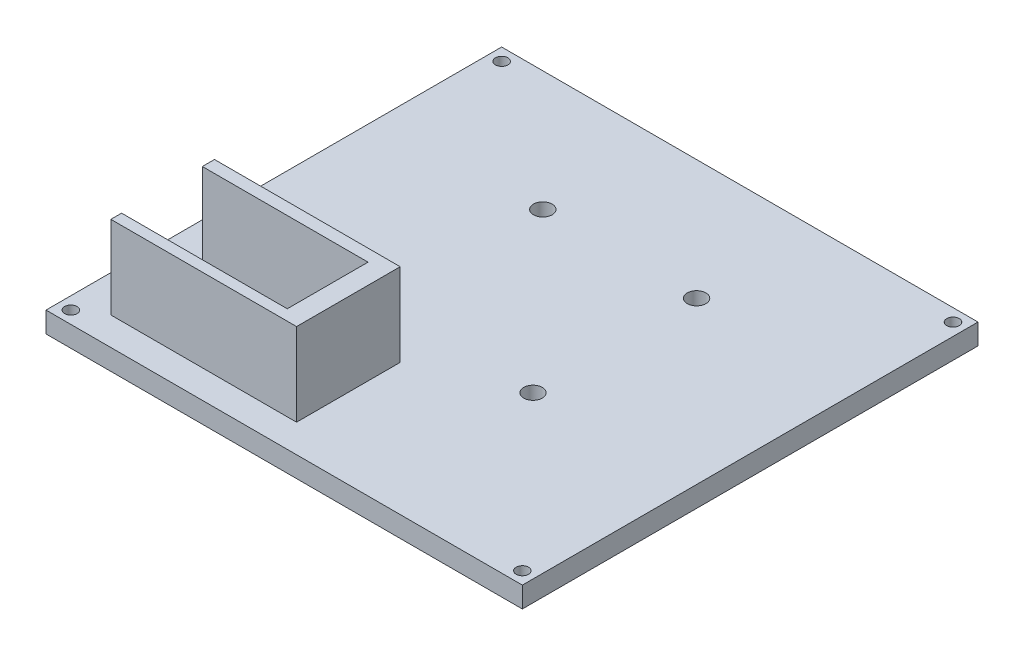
ISO-10303-21;
HEADER;
FILE_DESCRIPTION(('STEP AP214'),'2;1');
FILE_NAME('part.step','',(''),(''),'','','');
FILE_SCHEMA(('AUTOMOTIVE_DESIGN { 1 0 10303 214 1 1 1 1 }'));
ENDSEC;
DATA;
#1=APPLICATION_CONTEXT('core data for automotive mechanical design processes');
#2=APPLICATION_PROTOCOL_DEFINITION('international standard','automotive_design',2000,#1);
#3=PRODUCT_CONTEXT('',#1,'mechanical');
#4=PRODUCT('Part','Part','',(#3));
#5=PRODUCT_RELATED_PRODUCT_CATEGORY('part','',(#4));
#6=PRODUCT_DEFINITION_FORMATION('','',#4);
#7=PRODUCT_DEFINITION_CONTEXT('part definition',#1,'design');
#8=PRODUCT_DEFINITION('design','',#6,#7);
#9=PRODUCT_DEFINITION_SHAPE('','',#8);
#10=(LENGTH_UNIT() NAMED_UNIT(*) SI_UNIT(.MILLI.,.METRE.));
#11=(NAMED_UNIT(*) PLANE_ANGLE_UNIT() SI_UNIT($,.RADIAN.));
#12=(NAMED_UNIT(*) SI_UNIT($,.STERADIAN.) SOLID_ANGLE_UNIT());
#13=UNCERTAINTY_MEASURE_WITH_UNIT(LENGTH_MEASURE(1.E-05),#10,'distance_accuracy_value','');
#14=(GEOMETRIC_REPRESENTATION_CONTEXT(3) GLOBAL_UNCERTAINTY_ASSIGNED_CONTEXT((#13)) GLOBAL_UNIT_ASSIGNED_CONTEXT((#10,
#11,#12)) REPRESENTATION_CONTEXT('',''));
#15=CARTESIAN_POINT('',(0.,0.,0.));
#16=DIRECTION('',(0.,0.,1.));
#17=DIRECTION('',(1.,0.,0.));
#18=AXIS2_PLACEMENT_3D('',#15,#16,#17);
#19=CARTESIAN_POINT('',(0.,5.,0.));
#20=DIRECTION('',(0.,1.,0.));
#21=DIRECTION('',(0.,0.,1.));
#22=AXIS2_PLACEMENT_3D('',#19,#20,#21);
#23=PLANE('',#22);
#24=CARTESIAN_POINT('',(-26.882599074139,5.,32.0729223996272));
#25=DIRECTION('',(0.,1.,0.));
#26=DIRECTION('',(0.,0.,1.));
#27=AXIS2_PLACEMENT_3D('',#24,#25,#26);
#28=CIRCLE('',#27,2.25);
#29=CARTESIAN_POINT('',(-26.882599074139,5.,34.3229223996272));
#30=VERTEX_POINT('',#29);
#31=EDGE_CURVE('E377',#30,#30,#28,.T.);
#32=ORIENTED_EDGE('',*,*,#31,.F.);
#33=EDGE_LOOP('',(#32));
#34=FACE_BOUND('',#33,.T.);
#35=CARTESIAN_POINT('',(10.25343866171,5.,-7.4270776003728));
#36=DIRECTION('',(0.,1.,0.));
#37=DIRECTION('',(0.,0.,1.));
#38=AXIS2_PLACEMENT_3D('',#35,#36,#37);
#39=CIRCLE('',#38,2.25);
#40=CARTESIAN_POINT('',(10.25343866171,5.,-5.1770776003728));
#41=VERTEX_POINT('',#40);
#42=EDGE_CURVE('E373',#41,#41,#39,.T.);
#43=ORIENTED_EDGE('',*,*,#42,.F.);
#44=EDGE_LOOP('',(#43));
#45=FACE_BOUND('',#44,.T.);
#46=CARTESIAN_POINT('',(10.25343866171,5.,32.0729223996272));
#47=DIRECTION('',(0.,1.,0.));
#48=DIRECTION('',(0.,0.,1.));
#49=AXIS2_PLACEMENT_3D('',#46,#47,#48);
#50=CIRCLE('',#49,2.25);
#51=CARTESIAN_POINT('',(10.25343866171,5.,34.3229223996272));
#52=VERTEX_POINT('',#51);
#53=EDGE_CURVE('E368',#52,#52,#50,.T.);
#54=ORIENTED_EDGE('',*,*,#53,.F.);
#55=EDGE_LOOP('',(#54));
#56=FACE_BOUND('',#55,.T.);
#57=CARTESIAN_POINT('',(-26.882599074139,5.,-7.4270776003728));
#58=DIRECTION('',(0.,1.,0.));
#59=DIRECTION('',(0.,0.,1.));
#60=AXIS2_PLACEMENT_3D('',#57,#58,#59);
#61=CIRCLE('',#60,2.25);
#62=CARTESIAN_POINT('',(-26.882599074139,5.,-5.1770776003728));
#63=VERTEX_POINT('',#62);
#64=EDGE_CURVE('E380',#63,#63,#61,.T.);
#65=ORIENTED_EDGE('',*,*,#64,.F.);
#66=EDGE_LOOP('',(#65));
#67=FACE_BOUND('',#66,.T.);
#68=CARTESIAN_POINT('',(-62.81656133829,5.,70.5729223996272));
#69=DIRECTION('',(0.,1.,0.));
#70=DIRECTION('',(0.,0.,1.));
#71=AXIS2_PLACEMENT_3D('',#68,#69,#70);
#72=CIRCLE('',#71,1.5);
#73=CARTESIAN_POINT('',(-62.81656133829,5.,72.0729223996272));
#74=VERTEX_POINT('',#73);
#75=EDGE_CURVE('E201',#74,#74,#72,.T.);
#76=ORIENTED_EDGE('',*,*,#75,.F.);
#77=EDGE_LOOP('',(#76));
#78=FACE_BOUND('',#77,.T.);
#79=CARTESIAN_POINT('',(-62.81656133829,5.,-33.4270776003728));
#80=DIRECTION('',(0.,1.,0.));
#81=DIRECTION('',(0.,0.,1.));
#82=AXIS2_PLACEMENT_3D('',#79,#80,#81);
#83=CIRCLE('',#82,1.5);
#84=CARTESIAN_POINT('',(-62.81656133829,5.,-31.9270776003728));
#85=VERTEX_POINT('',#84);
#86=EDGE_CURVE('E213',#85,#85,#83,.T.);
#87=ORIENTED_EDGE('',*,*,#86,.F.);
#88=EDGE_LOOP('',(#87));
#89=FACE_BOUND('',#88,.T.);
#90=DIRECTION('',(0.,0.,1.));
#91=VECTOR('',#90,1.);
#92=CARTESIAN_POINT('',(-65.81656133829,5.,-36.4270776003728));
#93=LINE('',#92,#91);
#94=CARTESIAN_POINT('',(-65.81656133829,5.,-36.4270776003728));
#95=VERTEX_POINT('',#94);
#96=CARTESIAN_POINT('',(-65.81656133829,5.,73.5729223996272));
#97=VERTEX_POINT('',#96);
#98=EDGE_CURVE('E219',#95,#97,#93,.T.);
#99=ORIENTED_EDGE('',*,*,#98,.T.);
#100=DIRECTION('',(1.,0.,0.));
#101=VECTOR('',#100,1.);
#102=CARTESIAN_POINT('',(-65.81656133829,5.,73.5729223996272));
#103=LINE('',#102,#101);
#104=CARTESIAN_POINT('',(49.18343866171,5.,73.5729223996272));
#105=VERTEX_POINT('',#104);
#106=EDGE_CURVE('E222',#97,#105,#103,.T.);
#107=ORIENTED_EDGE('',*,*,#106,.T.);
#108=DIRECTION('',(0.,0.,-1.));
#109=VECTOR('',#108,1.);
#110=CARTESIAN_POINT('',(49.18343866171,5.,-36.4270776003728));
#111=LINE('',#110,#109);
#112=CARTESIAN_POINT('',(49.18343866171,5.,-36.4270776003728));
#113=VERTEX_POINT('',#112);
#114=EDGE_CURVE('E225',#105,#113,#111,.T.);
#115=ORIENTED_EDGE('',*,*,#114,.T.);
#116=DIRECTION('',(-1.,0.,0.));
#117=VECTOR('',#116,1.);
#118=CARTESIAN_POINT('',(-65.81656133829,5.,-36.4270776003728));
#119=LINE('',#118,#117);
#120=EDGE_CURVE('E227',#113,#95,#119,.T.);
#121=ORIENTED_EDGE('',*,*,#120,.T.);
#122=EDGE_LOOP('',(#99,#107,#115,#121));
#123=FACE_BOUND('',#122,.T.);
#124=CARTESIAN_POINT('',(46.18343866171,5.,-33.3940520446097));
#125=DIRECTION('',(0.,1.,0.));
#126=DIRECTION('',(0.,0.,1.));
#127=AXIS2_PLACEMENT_3D('',#124,#125,#126);
#128=CIRCLE('',#127,1.5);
#129=CARTESIAN_POINT('',(46.18343866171,5.,-31.8940520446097));
#130=VERTEX_POINT('',#129);
#131=EDGE_CURVE('E207',#130,#130,#128,.T.);
#132=ORIENTED_EDGE('',*,*,#131,.F.);
#133=EDGE_LOOP('',(#132));
#134=FACE_BOUND('',#133,.T.);
#135=CARTESIAN_POINT('',(46.18343866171,5.,70.5729223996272));
#136=DIRECTION('',(0.,1.,0.));
#137=DIRECTION('',(0.,0.,1.));
#138=AXIS2_PLACEMENT_3D('',#135,#136,#137);
#139=CIRCLE('',#138,1.5);
#140=CARTESIAN_POINT('',(46.18343866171,5.,72.0729223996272));
#141=VERTEX_POINT('',#140);
#142=EDGE_CURVE('E195',#141,#141,#139,.T.);
#143=ORIENTED_EDGE('',*,*,#142,.F.);
#144=EDGE_LOOP('',(#143));
#145=FACE_BOUND('',#144,.T.);
#146=DIRECTION('',(0.,0.,-1.));
#147=VECTOR('',#146,1.);
#148=CARTESIAN_POINT('',(-16.961839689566,5.,0.));
#149=LINE('',#148,#147);
#150=CARTESIAN_POINT('',(-16.961839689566,5.,64.181722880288));
#151=VERTEX_POINT('',#150);
#152=CARTESIAN_POINT('',(-16.961839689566,5.,44.681722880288));
#153=VERTEX_POINT('',#152);
#154=EDGE_CURVE('E49',#151,#153,#149,.T.);
#155=ORIENTED_EDGE('',*,*,#154,.T.);
#156=DIRECTION('',(1.,0.,0.));
#157=VECTOR('',#156,1.);
#158=CARTESIAN_POINT('',(0.,5.,44.681722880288));
#159=LINE('',#158,#157);
#160=CARTESIAN_POINT('',(-56.961839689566,5.,44.681722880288));
#161=VERTEX_POINT('',#160);
#162=EDGE_CURVE('E140',#161,#153,#159,.T.);
#163=ORIENTED_EDGE('',*,*,#162,.F.);
#164=DIRECTION('',(0.,0.,-1.));
#165=VECTOR('',#164,1.);
#166=CARTESIAN_POINT('',(-56.961839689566,5.,0.));
#167=LINE('',#166,#165);
#168=CARTESIAN_POINT('',(-56.961839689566,5.,41.7534532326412));
#169=VERTEX_POINT('',#168);
#170=EDGE_CURVE('E135',#161,#169,#167,.T.);
#171=ORIENTED_EDGE('',*,*,#170,.T.);
#172=DIRECTION('',(1.,0.,0.));
#173=VECTOR('',#172,1.);
#174=CARTESIAN_POINT('',(0.,5.,41.7534532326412));
#175=LINE('',#174,#173);
#176=CARTESIAN_POINT('',(-12.1251339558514,5.,41.7534532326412));
#177=VERTEX_POINT('',#176);
#178=EDGE_CURVE('E175',#169,#177,#175,.T.);
#179=ORIENTED_EDGE('',*,*,#178,.T.);
#180=DIRECTION('',(0.,0.,1.));
#181=VECTOR('',#180,1.);
#182=CARTESIAN_POINT('',(-12.1251339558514,5.,0.));
#183=LINE('',#182,#181);
#184=CARTESIAN_POINT('',(-12.1251339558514,5.,66.7754683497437));
#185=VERTEX_POINT('',#184);
#186=EDGE_CURVE('E173',#177,#185,#183,.T.);
#187=ORIENTED_EDGE('',*,*,#186,.T.);
#188=DIRECTION('',(1.,0.,0.));
#189=VECTOR('',#188,1.);
#190=CARTESIAN_POINT('',(0.,5.,66.7754683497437));
#191=LINE('',#190,#189);
#192=CARTESIAN_POINT('',(-56.961839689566,5.,66.7754683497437));
#193=VERTEX_POINT('',#192);
#194=EDGE_CURVE('E170',#193,#185,#191,.T.);
#195=ORIENTED_EDGE('',*,*,#194,.F.);
#196=DIRECTION('',(0.,0.,1.));
#197=VECTOR('',#196,1.);
#198=CARTESIAN_POINT('',(-56.961839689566,5.,0.));
#199=LINE('',#198,#197);
#200=CARTESIAN_POINT('',(-56.961839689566,5.,64.181722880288));
#201=VERTEX_POINT('',#200);
#202=EDGE_CURVE('E167',#201,#193,#199,.T.);
#203=ORIENTED_EDGE('',*,*,#202,.F.);
#204=DIRECTION('',(1.,0.,0.));
#205=VECTOR('',#204,1.);
#206=CARTESIAN_POINT('',(0.,5.,64.181722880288));
#207=LINE('',#206,#205);
#208=EDGE_CURVE('E54',#201,#151,#207,.T.);
#209=ORIENTED_EDGE('',*,*,#208,.T.);
#210=EDGE_LOOP('',(#155,#163,#171,#179,#187,#195,#203,#209));
#211=FACE_BOUND('',#210,.T.);
#212=ADVANCED_FACE('F34',(#34,#45,#56,#67,#78,#89,#123,#134,#145,#211),#23,.T.);
#213=CARTESIAN_POINT('',(0.,0.,0.));
#214=DIRECTION('',(0.,1.,0.));
#215=DIRECTION('',(0.,0.,1.));
#216=AXIS2_PLACEMENT_3D('',#213,#214,#215);
#217=PLANE('',#216);
#218=CARTESIAN_POINT('',(-26.882599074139,0.,32.0729223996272));
#219=DIRECTION('',(0.,1.,0.));
#220=DIRECTION('',(0.,0.,1.));
#221=AXIS2_PLACEMENT_3D('',#218,#219,#220);
#222=CIRCLE('',#221,2.25);
#223=CARTESIAN_POINT('',(-26.882599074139,0.,34.3229223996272));
#224=VERTEX_POINT('',#223);
#225=EDGE_CURVE('E381',#224,#224,#222,.T.);
#226=ORIENTED_EDGE('',*,*,#225,.T.);
#227=EDGE_LOOP('',(#226));
#228=FACE_BOUND('',#227,.T.);
#229=CARTESIAN_POINT('',(10.25343866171,0.,-7.4270776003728));
#230=DIRECTION('',(0.,1.,0.));
#231=DIRECTION('',(0.,0.,1.));
#232=AXIS2_PLACEMENT_3D('',#229,#230,#231);
#233=CIRCLE('',#232,2.25);
#234=CARTESIAN_POINT('',(10.25343866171,0.,-5.1770776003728));
#235=VERTEX_POINT('',#234);
#236=EDGE_CURVE('E370',#235,#235,#233,.T.);
#237=ORIENTED_EDGE('',*,*,#236,.T.);
#238=EDGE_LOOP('',(#237));
#239=FACE_BOUND('',#238,.T.);
#240=CARTESIAN_POINT('',(10.25343866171,0.,32.0729223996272));
#241=DIRECTION('',(0.,1.,0.));
#242=DIRECTION('',(0.,0.,1.));
#243=AXIS2_PLACEMENT_3D('',#240,#241,#242);
#244=CIRCLE('',#243,2.25);
#245=CARTESIAN_POINT('',(10.25343866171,0.,34.3229223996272));
#246=VERTEX_POINT('',#245);
#247=EDGE_CURVE('E365',#246,#246,#244,.T.);
#248=ORIENTED_EDGE('',*,*,#247,.T.);
#249=EDGE_LOOP('',(#248));
#250=FACE_BOUND('',#249,.T.);
#251=CARTESIAN_POINT('',(-26.882599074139,0.,-7.4270776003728));
#252=DIRECTION('',(0.,1.,0.));
#253=DIRECTION('',(0.,0.,1.));
#254=AXIS2_PLACEMENT_3D('',#251,#252,#253);
#255=CIRCLE('',#254,2.25);
#256=CARTESIAN_POINT('',(-26.882599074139,0.,-5.1770776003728));
#257=VERTEX_POINT('',#256);
#258=EDGE_CURVE('E164',#257,#257,#255,.T.);
#259=ORIENTED_EDGE('',*,*,#258,.T.);
#260=EDGE_LOOP('',(#259));
#261=FACE_BOUND('',#260,.T.);
#262=DIRECTION('',(0.,0.,1.));
#263=VECTOR('',#262,1.);
#264=CARTESIAN_POINT('',(-65.81656133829,0.,-36.4270776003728));
#265=LINE('',#264,#263);
#266=CARTESIAN_POINT('',(-65.81656133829,0.,-36.4270776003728));
#267=VERTEX_POINT('',#266);
#268=CARTESIAN_POINT('',(-65.81656133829,0.,73.5729223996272));
#269=VERTEX_POINT('',#268);
#270=EDGE_CURVE('E216',#267,#269,#265,.T.);
#271=ORIENTED_EDGE('',*,*,#270,.F.);
#272=DIRECTION('',(-1.,0.,0.));
#273=VECTOR('',#272,1.);
#274=CARTESIAN_POINT('',(-65.81656133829,0.,-36.4270776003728));
#275=LINE('',#274,#273);
#276=CARTESIAN_POINT('',(49.18343866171,0.,-36.4270776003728));
#277=VERTEX_POINT('',#276);
#278=EDGE_CURVE('E223',#277,#267,#275,.T.);
#279=ORIENTED_EDGE('',*,*,#278,.F.);
#280=DIRECTION('',(0.,0.,-1.));
#281=VECTOR('',#280,1.);
#282=CARTESIAN_POINT('',(49.18343866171,0.,-36.4270776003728));
#283=LINE('',#282,#281);
#284=CARTESIAN_POINT('',(49.18343866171,0.,73.5729223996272));
#285=VERTEX_POINT('',#284);
#286=EDGE_CURVE('E234',#285,#277,#283,.T.);
#287=ORIENTED_EDGE('',*,*,#286,.F.);
#288=DIRECTION('',(1.,0.,0.));
#289=VECTOR('',#288,1.);
#290=CARTESIAN_POINT('',(-65.81656133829,0.,73.5729223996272));
#291=LINE('',#290,#289);
#292=EDGE_CURVE('E232',#269,#285,#291,.T.);
#293=ORIENTED_EDGE('',*,*,#292,.F.);
#294=EDGE_LOOP('',(#271,#279,#287,#293));
#295=FACE_BOUND('',#294,.T.);
#296=CARTESIAN_POINT('',(-62.81656133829,0.,-33.4270776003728));
#297=DIRECTION('',(0.,1.,0.));
#298=DIRECTION('',(0.,0.,1.));
#299=AXIS2_PLACEMENT_3D('',#296,#297,#298);
#300=CIRCLE('',#299,1.5);
#301=CARTESIAN_POINT('',(-62.81656133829,0.,-31.9270776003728));
#302=VERTEX_POINT('',#301);
#303=EDGE_CURVE('E210',#302,#302,#300,.T.);
#304=ORIENTED_EDGE('',*,*,#303,.T.);
#305=EDGE_LOOP('',(#304));
#306=FACE_BOUND('',#305,.T.);
#307=CARTESIAN_POINT('',(46.18343866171,0.,-33.3940520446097));
#308=DIRECTION('',(0.,1.,0.));
#309=DIRECTION('',(0.,0.,1.));
#310=AXIS2_PLACEMENT_3D('',#307,#308,#309);
#311=CIRCLE('',#310,1.5);
#312=CARTESIAN_POINT('',(46.18343866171,0.,-31.8940520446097));
#313=VERTEX_POINT('',#312);
#314=EDGE_CURVE('E204',#313,#313,#311,.T.);
#315=ORIENTED_EDGE('',*,*,#314,.T.);
#316=EDGE_LOOP('',(#315));
#317=FACE_BOUND('',#316,.T.);
#318=CARTESIAN_POINT('',(-62.81656133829,0.,70.5729223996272));
#319=DIRECTION('',(0.,1.,0.));
#320=DIRECTION('',(0.,0.,1.));
#321=AXIS2_PLACEMENT_3D('',#318,#319,#320);
#322=CIRCLE('',#321,1.5);
#323=CARTESIAN_POINT('',(-62.81656133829,0.,72.0729223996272));
#324=VERTEX_POINT('',#323);
#325=EDGE_CURVE('E198',#324,#324,#322,.T.);
#326=ORIENTED_EDGE('',*,*,#325,.T.);
#327=EDGE_LOOP('',(#326));
#328=FACE_BOUND('',#327,.T.);
#329=CARTESIAN_POINT('',(46.18343866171,0.,70.5729223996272));
#330=DIRECTION('',(0.,1.,0.));
#331=DIRECTION('',(0.,0.,1.));
#332=AXIS2_PLACEMENT_3D('',#329,#330,#331);
#333=CIRCLE('',#332,1.5);
#334=CARTESIAN_POINT('',(46.18343866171,0.,72.0729223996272));
#335=VERTEX_POINT('',#334);
#336=EDGE_CURVE('E142',#335,#335,#333,.T.);
#337=ORIENTED_EDGE('',*,*,#336,.T.);
#338=EDGE_LOOP('',(#337));
#339=FACE_BOUND('',#338,.T.);
#340=ADVANCED_FACE('F252',(#228,#239,#250,#261,#295,#306,#317,#328,#339),#217,.F.);
#341=CARTESIAN_POINT('',(-65.81656133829,5.,-36.4270776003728));
#342=DIRECTION('',(1.,0.,0.));
#343=DIRECTION('',(0.,0.,-1.));
#344=AXIS2_PLACEMENT_3D('',#341,#342,#343);
#345=PLANE('',#344);
#346=ORIENTED_EDGE('',*,*,#270,.T.);
#347=DIRECTION('',(0.,-1.,0.));
#348=VECTOR('',#347,1.);
#349=CARTESIAN_POINT('',(-65.81656133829,5.,73.5729223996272));
#350=LINE('',#349,#348);
#351=EDGE_CURVE('E11',#97,#269,#350,.T.);
#352=ORIENTED_EDGE('',*,*,#351,.F.);
#353=ORIENTED_EDGE('',*,*,#98,.F.);
#354=DIRECTION('',(0.,-1.,0.));
#355=VECTOR('',#354,1.);
#356=CARTESIAN_POINT('',(-65.81656133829,5.,-36.4270776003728));
#357=LINE('',#356,#355);
#358=EDGE_CURVE('E229',#95,#267,#357,.T.);
#359=ORIENTED_EDGE('',*,*,#358,.T.);
#360=EDGE_LOOP('',(#346,#352,#353,#359));
#361=FACE_BOUND('',#360,.T.);
#362=ADVANCED_FACE('F36',(#361),#345,.F.);
#363=CARTESIAN_POINT('',(-65.81656133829,5.,73.5729223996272));
#364=DIRECTION('',(0.,0.,-1.));
#365=DIRECTION('',(-1.,0.,0.));
#366=AXIS2_PLACEMENT_3D('',#363,#364,#365);
#367=PLANE('',#366);
#368=ORIENTED_EDGE('',*,*,#292,.T.);
#369=DIRECTION('',(0.,-1.,0.));
#370=VECTOR('',#369,1.);
#371=CARTESIAN_POINT('',(49.18343866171,5.,73.5729223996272));
#372=LINE('',#371,#370);
#373=EDGE_CURVE('E42',#105,#285,#372,.T.);
#374=ORIENTED_EDGE('',*,*,#373,.F.);
#375=ORIENTED_EDGE('',*,*,#106,.F.);
#376=ORIENTED_EDGE('',*,*,#351,.T.);
#377=EDGE_LOOP('',(#368,#374,#375,#376));
#378=FACE_BOUND('',#377,.T.);
#379=ADVANCED_FACE('F263',(#378),#367,.F.);
#380=CARTESIAN_POINT('',(49.18343866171,5.,-36.4270776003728));
#381=DIRECTION('',(-1.,0.,0.));
#382=DIRECTION('',(0.,0.,1.));
#383=AXIS2_PLACEMENT_3D('',#380,#381,#382);
#384=PLANE('',#383);
#385=ORIENTED_EDGE('',*,*,#286,.T.);
#386=DIRECTION('',(0.,-1.,0.));
#387=VECTOR('',#386,1.);
#388=CARTESIAN_POINT('',(49.18343866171,5.,-36.4270776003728));
#389=LINE('',#388,#387);
#390=EDGE_CURVE('E239',#113,#277,#389,.T.);
#391=ORIENTED_EDGE('',*,*,#390,.F.);
#392=ORIENTED_EDGE('',*,*,#114,.F.);
#393=ORIENTED_EDGE('',*,*,#373,.T.);
#394=EDGE_LOOP('',(#385,#391,#392,#393));
#395=FACE_BOUND('',#394,.T.);
#396=ADVANCED_FACE('F246',(#395),#384,.F.);
#397=CARTESIAN_POINT('',(-65.81656133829,5.,-36.4270776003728));
#398=DIRECTION('',(0.,0.,1.));
#399=DIRECTION('',(1.,0.,0.));
#400=AXIS2_PLACEMENT_3D('',#397,#398,#399);
#401=PLANE('',#400);
#402=ORIENTED_EDGE('',*,*,#278,.T.);
#403=ORIENTED_EDGE('',*,*,#358,.F.);
#404=ORIENTED_EDGE('',*,*,#120,.F.);
#405=ORIENTED_EDGE('',*,*,#390,.T.);
#406=EDGE_LOOP('',(#402,#403,#404,#405));
#407=FACE_BOUND('',#406,.T.);
#408=ADVANCED_FACE('F256',(#407),#401,.F.);
#409=CARTESIAN_POINT('',(-62.81656133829,5.,-33.4270776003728));
#410=DIRECTION('',(0.,-1.,0.));
#411=DIRECTION('',(0.,0.,-1.));
#412=AXIS2_PLACEMENT_3D('',#409,#410,#411);
#413=CYLINDRICAL_SURFACE('',#412,1.5);
#414=ORIENTED_EDGE('',*,*,#86,.T.);
#415=EDGE_LOOP('',(#414));
#416=FACE_BOUND('',#415,.T.);
#417=ORIENTED_EDGE('',*,*,#303,.F.);
#418=EDGE_LOOP('',(#417));
#419=FACE_BOUND('',#418,.T.);
#420=ADVANCED_FACE('F281',(#416,#419),#413,.F.);
#421=CARTESIAN_POINT('',(46.18343866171,5.,-33.3940520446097));
#422=DIRECTION('',(0.,-1.,0.));
#423=DIRECTION('',(0.,0.,-1.));
#424=AXIS2_PLACEMENT_3D('',#421,#422,#423);
#425=CYLINDRICAL_SURFACE('',#424,1.5);
#426=ORIENTED_EDGE('',*,*,#131,.T.);
#427=EDGE_LOOP('',(#426));
#428=FACE_BOUND('',#427,.T.);
#429=ORIENTED_EDGE('',*,*,#314,.F.);
#430=EDGE_LOOP('',(#429));
#431=FACE_BOUND('',#430,.T.);
#432=ADVANCED_FACE('F288',(#428,#431),#425,.F.);
#433=CARTESIAN_POINT('',(-62.81656133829,5.,70.5729223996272));
#434=DIRECTION('',(0.,-1.,0.));
#435=DIRECTION('',(0.,0.,-1.));
#436=AXIS2_PLACEMENT_3D('',#433,#434,#435);
#437=CYLINDRICAL_SURFACE('',#436,1.5);
#438=ORIENTED_EDGE('',*,*,#75,.T.);
#439=EDGE_LOOP('',(#438));
#440=FACE_BOUND('',#439,.T.);
#441=ORIENTED_EDGE('',*,*,#325,.F.);
#442=EDGE_LOOP('',(#441));
#443=FACE_BOUND('',#442,.T.);
#444=ADVANCED_FACE('F293',(#440,#443),#437,.F.);
#445=CARTESIAN_POINT('',(46.18343866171,5.,70.5729223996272));
#446=DIRECTION('',(0.,-1.,0.));
#447=DIRECTION('',(0.,0.,-1.));
#448=AXIS2_PLACEMENT_3D('',#445,#446,#447);
#449=CYLINDRICAL_SURFACE('',#448,1.5);
#450=ORIENTED_EDGE('',*,*,#142,.T.);
#451=EDGE_LOOP('',(#450));
#452=FACE_BOUND('',#451,.T.);
#453=ORIENTED_EDGE('',*,*,#336,.F.);
#454=EDGE_LOOP('',(#453));
#455=FACE_BOUND('',#454,.T.);
#456=ADVANCED_FACE('F305',(#452,#455),#449,.F.);
#457=CARTESIAN_POINT('',(0.,25.,44.681722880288));
#458=DIRECTION('',(0.,0.,-1.));
#459=DIRECTION('',(-1.,0.,0.));
#460=AXIS2_PLACEMENT_3D('',#457,#458,#459);
#461=PLANE('',#460);
#462=ORIENTED_EDGE('',*,*,#162,.T.);
#463=DIRECTION('',(0.,-1.,0.));
#464=VECTOR('',#463,1.);
#465=CARTESIAN_POINT('',(-16.961839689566,25.,44.681722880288));
#466=LINE('',#465,#464);
#467=CARTESIAN_POINT('',(-16.961839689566,25.,44.681722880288));
#468=VERTEX_POINT('',#467);
#469=EDGE_CURVE('E138',#468,#153,#466,.T.);
#470=ORIENTED_EDGE('',*,*,#469,.F.);
#471=DIRECTION('',(1.,0.,0.));
#472=VECTOR('',#471,1.);
#473=CARTESIAN_POINT('',(0.,25.,44.681722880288));
#474=LINE('',#473,#472);
#475=CARTESIAN_POINT('',(-56.961839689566,25.,44.681722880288));
#476=VERTEX_POINT('',#475);
#477=EDGE_CURVE('E123',#476,#468,#474,.T.);
#478=ORIENTED_EDGE('',*,*,#477,.F.);
#479=DIRECTION('',(0.,-1.,0.));
#480=VECTOR('',#479,1.);
#481=CARTESIAN_POINT('',(-56.961839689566,25.,44.681722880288));
#482=LINE('',#481,#480);
#483=EDGE_CURVE('E162',#476,#161,#482,.T.);
#484=ORIENTED_EDGE('',*,*,#483,.T.);
#485=EDGE_LOOP('',(#462,#470,#478,#484));
#486=FACE_BOUND('',#485,.T.);
#487=ADVANCED_FACE('F139',(#486),#461,.F.);
#488=CARTESIAN_POINT('',(-16.961839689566,25.,0.));
#489=DIRECTION('',(-1.,0.,0.));
#490=DIRECTION('',(0.,0.,1.));
#491=AXIS2_PLACEMENT_3D('',#488,#489,#490);
#492=PLANE('',#491);
#493=ORIENTED_EDGE('',*,*,#154,.F.);
#494=DIRECTION('',(0.,-1.,0.));
#495=VECTOR('',#494,1.);
#496=CARTESIAN_POINT('',(-16.961839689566,25.,64.181722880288));
#497=LINE('',#496,#495);
#498=CARTESIAN_POINT('',(-16.961839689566,25.,64.181722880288));
#499=VERTEX_POINT('',#498);
#500=EDGE_CURVE('E143',#499,#151,#497,.T.);
#501=ORIENTED_EDGE('',*,*,#500,.F.);
#502=DIRECTION('',(0.,0.,-1.));
#503=VECTOR('',#502,1.);
#504=CARTESIAN_POINT('',(-16.961839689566,25.,0.));
#505=LINE('',#504,#503);
#506=EDGE_CURVE('E128',#499,#468,#505,.T.);
#507=ORIENTED_EDGE('',*,*,#506,.T.);
#508=ORIENTED_EDGE('',*,*,#469,.T.);
#509=EDGE_LOOP('',(#493,#501,#507,#508));
#510=FACE_BOUND('',#509,.T.);
#511=ADVANCED_FACE('F145',(#510),#492,.T.);
#512=CARTESIAN_POINT('',(0.,25.,64.181722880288));
#513=DIRECTION('',(0.,0.,-1.));
#514=DIRECTION('',(-1.,0.,0.));
#515=AXIS2_PLACEMENT_3D('',#512,#513,#514);
#516=PLANE('',#515);
#517=ORIENTED_EDGE('',*,*,#208,.F.);
#518=DIRECTION('',(0.,-1.,0.));
#519=VECTOR('',#518,1.);
#520=CARTESIAN_POINT('',(-56.961839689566,25.,64.181722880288));
#521=LINE('',#520,#519);
#522=CARTESIAN_POINT('',(-56.961839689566,25.,64.181722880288));
#523=VERTEX_POINT('',#522);
#524=EDGE_CURVE('E191',#523,#201,#521,.T.);
#525=ORIENTED_EDGE('',*,*,#524,.F.);
#526=DIRECTION('',(1.,0.,0.));
#527=VECTOR('',#526,1.);
#528=CARTESIAN_POINT('',(0.,25.,64.181722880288));
#529=LINE('',#528,#527);
#530=EDGE_CURVE('E146',#523,#499,#529,.T.);
#531=ORIENTED_EDGE('',*,*,#530,.T.);
#532=ORIENTED_EDGE('',*,*,#500,.T.);
#533=EDGE_LOOP('',(#517,#525,#531,#532));
#534=FACE_BOUND('',#533,.T.);
#535=ADVANCED_FACE('F319',(#534),#516,.T.);
#536=CARTESIAN_POINT('',(-56.961839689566,25.,0.));
#537=DIRECTION('',(1.,0.,0.));
#538=DIRECTION('',(0.,0.,-1.));
#539=AXIS2_PLACEMENT_3D('',#536,#537,#538);
#540=PLANE('',#539);
#541=ORIENTED_EDGE('',*,*,#202,.T.);
#542=DIRECTION('',(0.,-1.,0.));
#543=VECTOR('',#542,1.);
#544=CARTESIAN_POINT('',(-56.961839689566,25.,66.7754683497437));
#545=LINE('',#544,#543);
#546=CARTESIAN_POINT('',(-56.961839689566,25.,66.7754683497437));
#547=VERTEX_POINT('',#546);
#548=EDGE_CURVE('E188',#547,#193,#545,.T.);
#549=ORIENTED_EDGE('',*,*,#548,.F.);
#550=DIRECTION('',(0.,0.,1.));
#551=VECTOR('',#550,1.);
#552=CARTESIAN_POINT('',(-56.961839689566,25.,0.));
#553=LINE('',#552,#551);
#554=EDGE_CURVE('E148',#523,#547,#553,.T.);
#555=ORIENTED_EDGE('',*,*,#554,.F.);
#556=ORIENTED_EDGE('',*,*,#524,.T.);
#557=EDGE_LOOP('',(#541,#549,#555,#556));
#558=FACE_BOUND('',#557,.T.);
#559=ADVANCED_FACE('F322',(#558),#540,.F.);
#560=CARTESIAN_POINT('',(0.,25.,66.7754683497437));
#561=DIRECTION('',(0.,0.,-1.));
#562=DIRECTION('',(-1.,0.,0.));
#563=AXIS2_PLACEMENT_3D('',#560,#561,#562);
#564=PLANE('',#563);
#565=ORIENTED_EDGE('',*,*,#194,.T.);
#566=DIRECTION('',(0.,-1.,0.));
#567=VECTOR('',#566,1.);
#568=CARTESIAN_POINT('',(-12.1251339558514,25.,66.7754683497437));
#569=LINE('',#568,#567);
#570=CARTESIAN_POINT('',(-12.1251339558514,25.,66.7754683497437));
#571=VERTEX_POINT('',#570);
#572=EDGE_CURVE('E185',#571,#185,#569,.T.);
#573=ORIENTED_EDGE('',*,*,#572,.F.);
#574=DIRECTION('',(1.,0.,0.));
#575=VECTOR('',#574,1.);
#576=CARTESIAN_POINT('',(0.,25.,66.7754683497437));
#577=LINE('',#576,#575);
#578=EDGE_CURVE('E153',#547,#571,#577,.T.);
#579=ORIENTED_EDGE('',*,*,#578,.F.);
#580=ORIENTED_EDGE('',*,*,#548,.T.);
#581=EDGE_LOOP('',(#565,#573,#579,#580));
#582=FACE_BOUND('',#581,.T.);
#583=ADVANCED_FACE('F326',(#582),#564,.F.);
#584=CARTESIAN_POINT('',(-12.1251339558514,25.,0.));
#585=DIRECTION('',(1.,0.,0.));
#586=DIRECTION('',(0.,0.,-1.));
#587=AXIS2_PLACEMENT_3D('',#584,#585,#586);
#588=PLANE('',#587);
#589=ORIENTED_EDGE('',*,*,#186,.F.);
#590=DIRECTION('',(0.,-1.,0.));
#591=VECTOR('',#590,1.);
#592=CARTESIAN_POINT('',(-12.1251339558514,25.,41.7534532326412));
#593=LINE('',#592,#591);
#594=CARTESIAN_POINT('',(-12.1251339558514,25.,41.7534532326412));
#595=VERTEX_POINT('',#594);
#596=EDGE_CURVE('E182',#595,#177,#593,.T.);
#597=ORIENTED_EDGE('',*,*,#596,.F.);
#598=DIRECTION('',(0.,0.,1.));
#599=VECTOR('',#598,1.);
#600=CARTESIAN_POINT('',(-12.1251339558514,25.,0.));
#601=LINE('',#600,#599);
#602=EDGE_CURVE('E155',#595,#571,#601,.T.);
#603=ORIENTED_EDGE('',*,*,#602,.T.);
#604=ORIENTED_EDGE('',*,*,#572,.T.);
#605=EDGE_LOOP('',(#589,#597,#603,#604));
#606=FACE_BOUND('',#605,.T.);
#607=ADVANCED_FACE('F330',(#606),#588,.T.);
#608=CARTESIAN_POINT('',(0.,25.,41.7534532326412));
#609=DIRECTION('',(0.,0.,-1.));
#610=DIRECTION('',(-1.,0.,0.));
#611=AXIS2_PLACEMENT_3D('',#608,#609,#610);
#612=PLANE('',#611);
#613=ORIENTED_EDGE('',*,*,#178,.F.);
#614=DIRECTION('',(0.,-1.,0.));
#615=VECTOR('',#614,1.);
#616=CARTESIAN_POINT('',(-56.961839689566,25.,41.7534532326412));
#617=LINE('',#616,#615);
#618=CARTESIAN_POINT('',(-56.961839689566,25.,41.7534532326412));
#619=VERTEX_POINT('',#618);
#620=EDGE_CURVE('E179',#619,#169,#617,.T.);
#621=ORIENTED_EDGE('',*,*,#620,.F.);
#622=DIRECTION('',(1.,0.,0.));
#623=VECTOR('',#622,1.);
#624=CARTESIAN_POINT('',(0.,25.,41.7534532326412));
#625=LINE('',#624,#623);
#626=EDGE_CURVE('E158',#619,#595,#625,.T.);
#627=ORIENTED_EDGE('',*,*,#626,.T.);
#628=ORIENTED_EDGE('',*,*,#596,.T.);
#629=EDGE_LOOP('',(#613,#621,#627,#628));
#630=FACE_BOUND('',#629,.T.);
#631=ADVANCED_FACE('F334',(#630),#612,.T.);
#632=CARTESIAN_POINT('',(-56.961839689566,25.,0.));
#633=DIRECTION('',(-1.,0.,0.));
#634=DIRECTION('',(0.,0.,1.));
#635=AXIS2_PLACEMENT_3D('',#632,#633,#634);
#636=PLANE('',#635);
#637=ORIENTED_EDGE('',*,*,#170,.F.);
#638=ORIENTED_EDGE('',*,*,#483,.F.);
#639=DIRECTION('',(0.,0.,-1.));
#640=VECTOR('',#639,1.);
#641=CARTESIAN_POINT('',(-56.961839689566,25.,0.));
#642=LINE('',#641,#640);
#643=EDGE_CURVE('E132',#476,#619,#642,.T.);
#644=ORIENTED_EDGE('',*,*,#643,.T.);
#645=ORIENTED_EDGE('',*,*,#620,.T.);
#646=EDGE_LOOP('',(#637,#638,#644,#645));
#647=FACE_BOUND('',#646,.T.);
#648=ADVANCED_FACE('F338',(#647),#636,.T.);
#649=CARTESIAN_POINT('',(0.,25.,0.));
#650=DIRECTION('',(0.,1.,0.));
#651=DIRECTION('',(0.,0.,1.));
#652=AXIS2_PLACEMENT_3D('',#649,#650,#651);
#653=PLANE('',#652);
#654=ORIENTED_EDGE('',*,*,#477,.T.);
#655=ORIENTED_EDGE('',*,*,#506,.F.);
#656=ORIENTED_EDGE('',*,*,#530,.F.);
#657=ORIENTED_EDGE('',*,*,#554,.T.);
#658=ORIENTED_EDGE('',*,*,#578,.T.);
#659=ORIENTED_EDGE('',*,*,#602,.F.);
#660=ORIENTED_EDGE('',*,*,#626,.F.);
#661=ORIENTED_EDGE('',*,*,#643,.F.);
#662=EDGE_LOOP('',(#654,#655,#656,#657,#658,#659,#660,#661));
#663=FACE_BOUND('',#662,.T.);
#664=ADVANCED_FACE('F125',(#663),#653,.T.);
#665=CARTESIAN_POINT('',(-26.882599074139,0.,-7.4270776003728));
#666=DIRECTION('',(0.,1.,0.));
#667=DIRECTION('',(0.,0.,1.));
#668=AXIS2_PLACEMENT_3D('',#665,#666,#667);
#669=CYLINDRICAL_SURFACE('',#668,2.25);
#670=ORIENTED_EDGE('',*,*,#258,.F.);
#671=EDGE_LOOP('',(#670));
#672=FACE_BOUND('',#671,.T.);
#673=ORIENTED_EDGE('',*,*,#64,.T.);
#674=EDGE_LOOP('',(#673));
#675=FACE_BOUND('',#674,.T.);
#676=ADVANCED_FACE('F345',(#672,#675),#669,.F.);
#677=CARTESIAN_POINT('',(10.25343866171,0.,32.0729223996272));
#678=DIRECTION('',(0.,1.,0.));
#679=DIRECTION('',(0.,0.,1.));
#680=AXIS2_PLACEMENT_3D('',#677,#678,#679);
#681=CYLINDRICAL_SURFACE('',#680,2.25);
#682=ORIENTED_EDGE('',*,*,#247,.F.);
#683=EDGE_LOOP('',(#682));
#684=FACE_BOUND('',#683,.T.);
#685=ORIENTED_EDGE('',*,*,#53,.T.);
#686=EDGE_LOOP('',(#685));
#687=FACE_BOUND('',#686,.T.);
#688=ADVANCED_FACE('F348',(#684,#687),#681,.F.);
#689=CARTESIAN_POINT('',(10.25343866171,0.,-7.4270776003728));
#690=DIRECTION('',(0.,1.,0.));
#691=DIRECTION('',(0.,0.,1.));
#692=AXIS2_PLACEMENT_3D('',#689,#690,#691);
#693=CYLINDRICAL_SURFACE('',#692,2.25);
#694=ORIENTED_EDGE('',*,*,#236,.F.);
#695=EDGE_LOOP('',(#694));
#696=FACE_BOUND('',#695,.T.);
#697=ORIENTED_EDGE('',*,*,#42,.T.);
#698=EDGE_LOOP('',(#697));
#699=FACE_BOUND('',#698,.T.);
#700=ADVANCED_FACE('F350',(#696,#699),#693,.F.);
#701=CARTESIAN_POINT('',(-26.882599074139,0.,32.0729223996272));
#702=DIRECTION('',(0.,1.,0.));
#703=DIRECTION('',(0.,0.,1.));
#704=AXIS2_PLACEMENT_3D('',#701,#702,#703);
#705=CYLINDRICAL_SURFACE('',#704,2.25);
#706=ORIENTED_EDGE('',*,*,#225,.F.);
#707=EDGE_LOOP('',(#706));
#708=FACE_BOUND('',#707,.T.);
#709=ORIENTED_EDGE('',*,*,#31,.T.);
#710=EDGE_LOOP('',(#709));
#711=FACE_BOUND('',#710,.T.);
#712=ADVANCED_FACE('F353',(#708,#711),#705,.F.);
#713=CLOSED_SHELL('',(#212,#340,#362,#379,#396,#408,#420,#432,#444,#456,#487,#511,#535,#559,
#583,#607,#631,#648,#664,#676,#688,#700,#712));
#714=MANIFOLD_SOLID_BREP('B2',#713);
#715=ADVANCED_BREP_SHAPE_REPRESENTATION('',(#18,#714),#14);
#716=SHAPE_DEFINITION_REPRESENTATION(#9,#715);
ENDSEC;
END-ISO-10303-21;
